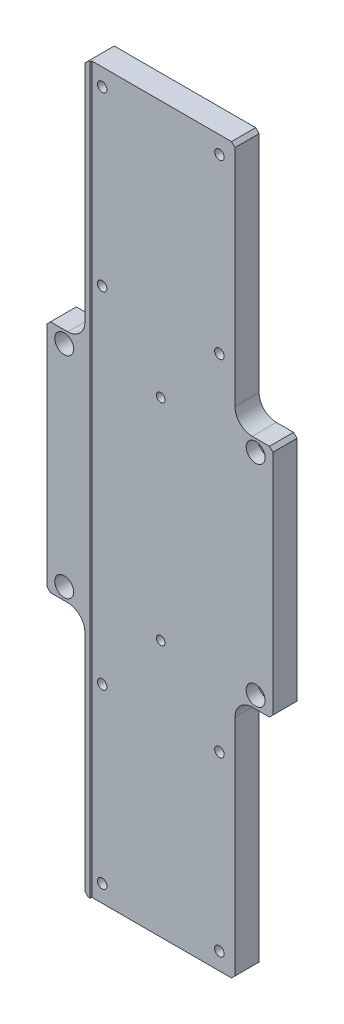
from build123d import *

# Parameters (mm, degrees)
SKETCH_1_W                   = 86
SKETCH_1_H                   = 142
SKETCH_1_W_2                 = 22
SKETCH_1_H_2                 = 136
EXTRUDE_1_DEPTH              = 7.5
SKETCH_2_W                   = 105
SKETCH_2_H                   = 420
CUT_EXTRUDE_1_DEPTH          = 1
F_5_0MM_1_D                  = 5
HOLE_WIZARD_M6_1_D           = 6.6
HOLE_WIZARD_M6_1_CBORE_D     = 11
HOLE_WIZARD_M6_1_CBORE_DEPTH = 8
HOLE_WIZARD_M5_1_D           = 5.5
HOLE_WIZARD_M5_1_CBORE_D     = 9.5
HOLE_WIZARD_M5_1_CBORE_DEPTH = 7
PATTERN_LINEAR_1_COUNT       = 2
PATTERN_LINEAR_1_PITCH       = 300
FILLET_1_R                   = 10
CHAMFER_1_SIZE               = 2


with BuildPart() as part:
    # Sketch 1 → Extrude 1 (new, symmetric)
    with BuildSketch(Plane.XY):
        with Locations((0, 139)):
            Rectangle(SKETCH_1_W, SKETCH_1_H)
        with Locations((-54, 0)):
            Rectangle(SKETCH_1_W_2, SKETCH_1_H_2)
        Rectangle(SKETCH_1_W, SKETCH_1_H_2)
        with Locations((54, 0)):
            Rectangle(SKETCH_1_W_2, SKETCH_1_H_2)
        with Locations((0, -139)):
            Rectangle(SKETCH_1_W, SKETCH_1_H)
    extrude(amount=EXTRUDE_1_DEPTH, both=True)

    # Sketch 2 → Cut-Extrude 1 (cut)
    with BuildSketch(Plane.XY.offset(7.5)):
        with Locations((12.5, 0)):
            Rectangle(SKETCH_2_W, SKETCH_2_H)
    extrude(amount=-CUT_EXTRUDE_1_DEPTH, mode=Mode.SUBTRACT)

    # 5.0mm _ _1 (through all)
    with Locations(Plane.XY.offset(6.5)):
        with Locations((0, -61), (0, 61)):
            Hole(F_5_0MM_1_D / 2)

    # Hole Wizard M6 _ _ _ _ _1 (through all)
    with Locations(Plane.XY.offset(7.5)):
        with Locations((-55, 61), (-55, -61), (55, 61), (55, -61)):
            CounterBoreHole(HOLE_WIZARD_M6_1_D / 2, HOLE_WIZARD_M6_1_CBORE_D / 2, HOLE_WIZARD_M6_1_CBORE_DEPTH)

    # Hole Wizard M5 _ _ _ _ _1 (through all)
    with Locations(Plane(origin=(0, 0, -7.5), x_dir=(-1, 0, 0), z_dir=(0, 0, -1))):
        with Locations((-34, 200), (34, 200), (-34, 100), (34, 100)):
            hole_wizard_m5_1 = CounterBoreHole(HOLE_WIZARD_M5_1_D / 2, HOLE_WIZARD_M5_1_CBORE_D / 2, HOLE_WIZARD_M5_1_CBORE_DEPTH)

    # Pattern Linear 1: Hole Wizard M5 _ _ _ _ _1 ×2
    with Locations(*[(0, -i * PATTERN_LINEAR_1_PITCH, 0) for i in range(1, PATTERN_LINEAR_1_COUNT)]):
        add(hole_wizard_m5_1, mode=Mode.SUBTRACT)

    # Fillet 1
    fillet_1_edges = [part.edges().sort_by_distance(p)[0] for p in [
        (-43, -68, 0),
        (-43, 68, 0),
        (43, 68, -0.5),
        (43, -68, -0.5),
    ]]
    fillet(fillet_1_edges, radius=FILLET_1_R)

    # Chamfer 1
    chamfer_1_edges = [part.edges().sort_by_distance(p)[0] for p in [
        (-43, -210, 0),
        (-65, -68, 0),
        (-65, 68, 0),
        (-43, 210, 0),
        (65, 68, -0.5),
        (65, -68, -0.5),
        (43, -210, -0.5),
        (43, 210, -0.5),
    ]]
    chamfer(chamfer_1_edges, length=CHAMFER_1_SIZE)


solid = part.part
